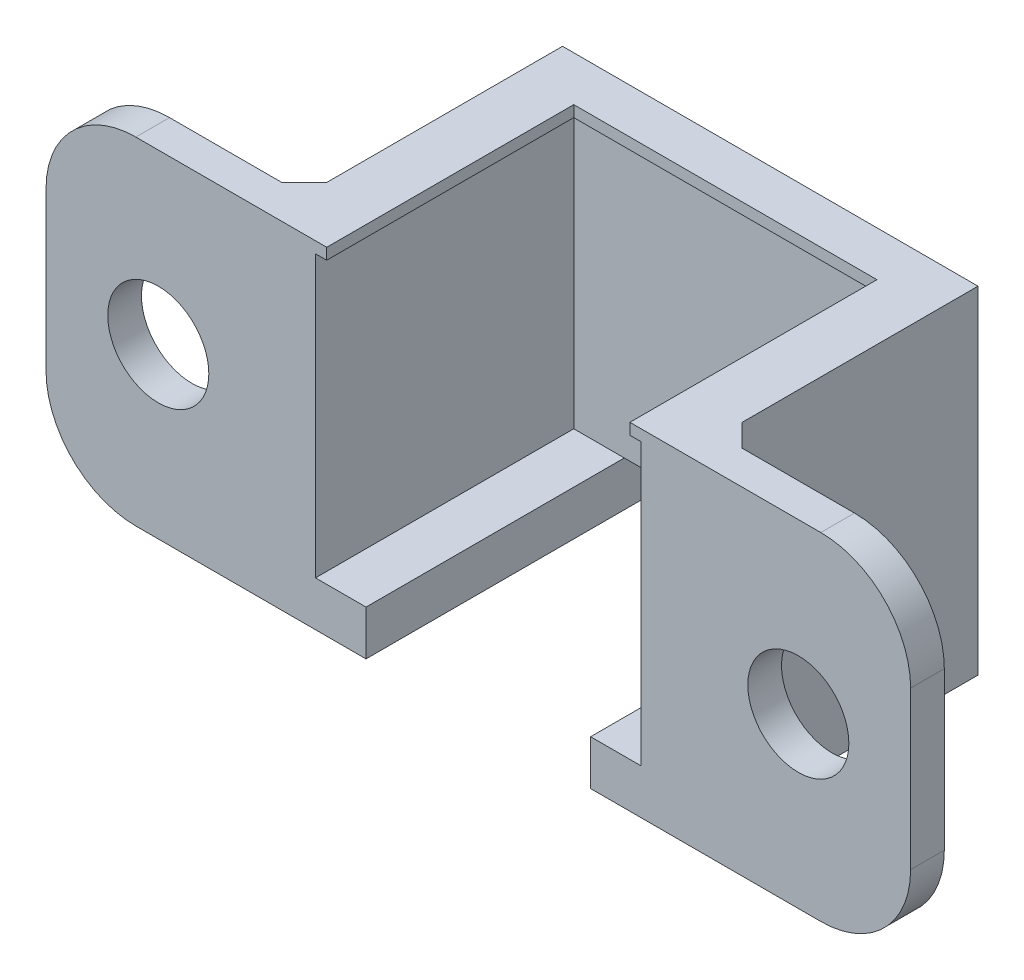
from build123d import *

# Parameters (mm, degrees)
BOSS_EXTRUDE1_DEPTH  = 13
SKETCH2_W            = 18.5
SKETCH2_H            = 15
BOSS_EXTRUDE2_DEPTH  = 1.5
CUT_EXTRUDE1_DEPTH   = 2
BOSS_EXTRUDE3_DEPTH  = 0.5
SKETCH6_W            = 10
SKETCH6_H            = 15
BOSS_EXTRUDE4_DEPTH  = 1.5
FILLET1_R            = 4
FILLET1_OF_MIRROR3_R = 4
CHAMFER1_SIZE        = 1


with BuildPart() as part:
    # Sketch1 → Boss-Extrude1 (new body)
    with BuildSketch(Plane.XY):
        Polygon((0, 0), (0, 15), (2, 15), (2, 13), (2, 2), (16.5, 2), (16.5, 13), (16.5, 15), (18.5, 15), (18.5, 0), align=None)
    extrude(amount=BOSS_EXTRUDE1_DEPTH)

    # Sketch2 → Boss-Extrude2 (add)
    with BuildSketch(Plane.XY):
        with Locations((9.25, 7.5)):
            Rectangle(SKETCH2_W, SKETCH2_H)
    extrude(amount=BOSS_EXTRUDE2_DEPTH)

    # Sketch3 → Cut-Extrude1 (cut)
    with BuildSketch(Plane.XZ):
        Polygon((9.25, 0), (4.25, 0), (4.25, 13), (14.25, 13), (14.25, 0), align=None)
    extrude(amount=-CUT_EXTRUDE1_DEPTH, mode=Mode.SUBTRACT)

    # Sketch5 → Boss-Extrude3 (add)
    with BuildSketch(Plane(origin=(0, 15, 0), x_dir=(1, 0, 0), z_dir=(0, 1, 0))):
        Polygon((16.5, -13), (16.5, -1.5), (2, -1.5), (2, -13), (2.5, -13), (2.5, -2), (16, -2), (16, -13), align=None)
    extrude(amount=-BOSS_EXTRUDE3_DEPTH)

    # Sketch6 → Boss-Extrude4 (add)
    with BuildSketch(Plane.XY.offset(13)):
        with Locations((23.5, 7.5)):
            Rectangle(SKETCH6_W, SKETCH6_H)
    boss_extrude4 = extrude(amount=-BOSS_EXTRUDE4_DEPTH)

    # Sketch8 → M4 Clearance Hole1 (revolve, cut)
    with BuildSketch(Plane(origin=(23.5, 7.5, 11.5), x_dir=(0, 1, 0), z_dir=(1, 0, 0))):
        Polygon((0, 0), (0, 14.051936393), (2.25, 12.7), (2.25, 0), align=None)
    m4_clearance_hole1 = revolve(axis=Axis((23.5, 7.5, 5.15), (0, 0, 1)), mode=Mode.SUBTRACT)

    # Fillet1
    fillet1_edges = [part.edges().sort_by_distance(p)[0] for p in [
        (28.5, 15, 12.25),
        (28.5, 0, 12.25),
    ]]
    fillet(fillet1_edges, radius=FILLET1_R)

    # Mirror3: Boss-Extrude4, M4 Clearance Hole1 across plane
    add(boss_extrude4.mirror(Plane(origin=(9.25, 0, 0), x_dir=(0, 0, 1), z_dir=(1, 0, 0))))
    add(m4_clearance_hole1.mirror(Plane(origin=(9.25, 0, 0), x_dir=(0, 0, 1), z_dir=(1, 0, 0))), mode=Mode.SUBTRACT)

    # Fillet1 of Mirror3
    fillet1_of_mirror3_edges = [part.edges().sort_by_distance(p)[0] for p in [
        (-10, 15, 12.25),
        (-10, 0, 12.25),
    ]]
    fillet(fillet1_of_mirror3_edges, radius=FILLET1_OF_MIRROR3_R)

    # Chamfer1
    chamfer1_edges = [part.edges().sort_by_distance(p)[0] for p in [
        (0, 7.5, 11.5),
        (18.5, 7.5, 11.5),
    ]]
    chamfer(chamfer1_edges, length=CHAMFER1_SIZE)


solid = part.part
